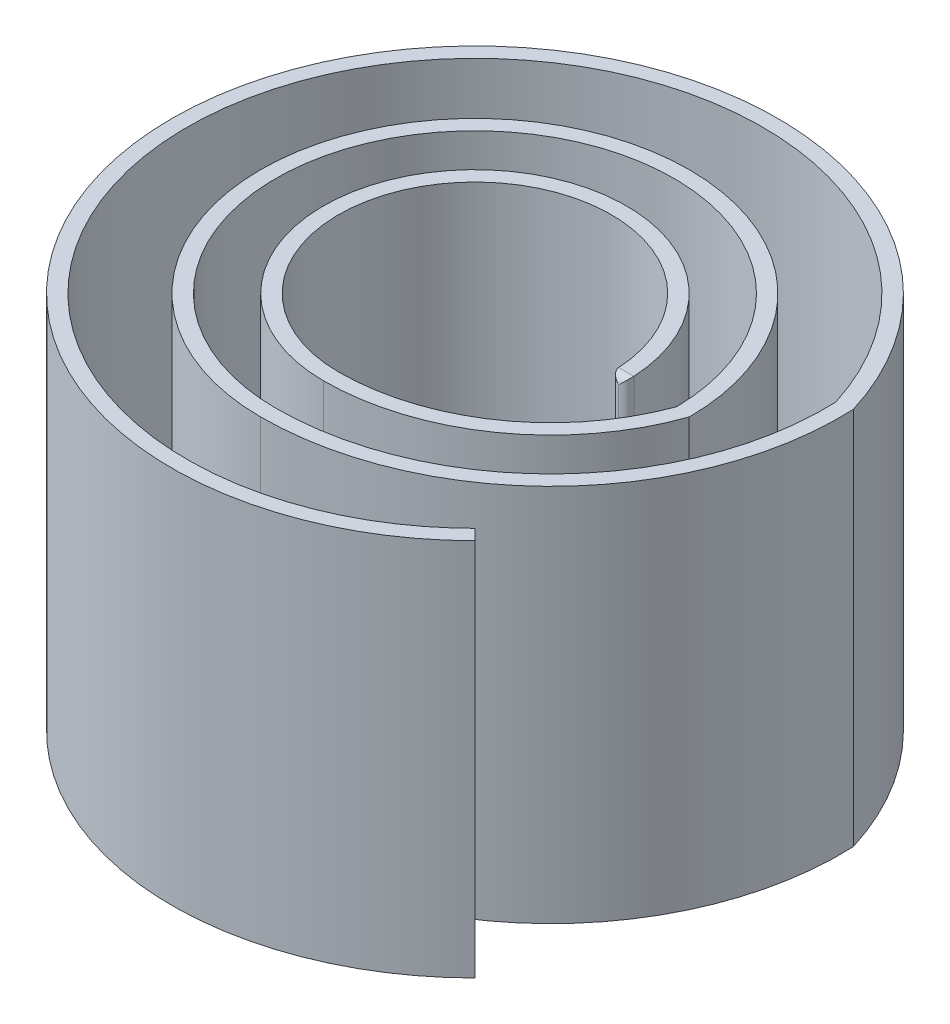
ISO-10303-21;
HEADER;
FILE_DESCRIPTION(('STEP AP214'),'2;1');
FILE_NAME('part.step','',(''),(''),'','','');
FILE_SCHEMA(('AUTOMOTIVE_DESIGN { 1 0 10303 214 1 1 1 1 }'));
ENDSEC;
DATA;
#1=APPLICATION_CONTEXT('core data for automotive mechanical design processes');
#2=APPLICATION_PROTOCOL_DEFINITION('international standard','automotive_design',2000,#1);
#3=PRODUCT_CONTEXT('',#1,'mechanical');
#4=PRODUCT('Part','Part','',(#3));
#5=PRODUCT_RELATED_PRODUCT_CATEGORY('part','',(#4));
#6=PRODUCT_DEFINITION_FORMATION('','',#4);
#7=PRODUCT_DEFINITION_CONTEXT('part definition',#1,'design');
#8=PRODUCT_DEFINITION('design','',#6,#7);
#9=PRODUCT_DEFINITION_SHAPE('','',#8);
#10=(LENGTH_UNIT() NAMED_UNIT(*) SI_UNIT(.MILLI.,.METRE.));
#11=(NAMED_UNIT(*) PLANE_ANGLE_UNIT() SI_UNIT($,.RADIAN.));
#12=(NAMED_UNIT(*) SI_UNIT($,.STERADIAN.) SOLID_ANGLE_UNIT());
#13=UNCERTAINTY_MEASURE_WITH_UNIT(LENGTH_MEASURE(1.E-05),#10,'distance_accuracy_value','');
#14=(GEOMETRIC_REPRESENTATION_CONTEXT(3) GLOBAL_UNCERTAINTY_ASSIGNED_CONTEXT((#13)) GLOBAL_UNIT_ASSIGNED_CONTEXT((#10,
#11,#12)) REPRESENTATION_CONTEXT('',''));
#15=CARTESIAN_POINT('',(0.,0.,0.));
#16=DIRECTION('',(0.,0.,1.));
#17=DIRECTION('',(1.,0.,0.));
#18=AXIS2_PLACEMENT_3D('',#15,#16,#17);
#19=CARTESIAN_POINT('',(0.,50.,0.));
#20=DIRECTION('',(0.,-1.,0.));
#21=DIRECTION('',(0.,0.,-1.));
#22=AXIS2_PLACEMENT_3D('',#19,#20,#21);
#23=CYLINDRICAL_SURFACE('',#22,38.);
#24=CARTESIAN_POINT('',(0.,0.,0.));
#25=DIRECTION('',(0.,1.,0.));
#26=DIRECTION('',(0.,0.,1.));
#27=AXIS2_PLACEMENT_3D('',#24,#25,#26);
#28=CIRCLE('',#27,38.);
#29=CARTESIAN_POINT('',(36.2583005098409,0.,-11.3725830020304));
#30=VERTEX_POINT('',#29);
#31=CARTESIAN_POINT('',(25.4191177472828,0.,28.2465653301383));
#32=VERTEX_POINT('',#31);
#33=EDGE_CURVE('E148',#30,#32,#28,.T.);
#34=ORIENTED_EDGE('',*,*,#33,.F.);
#35=DIRECTION('',(0.,-1.,0.));
#36=VECTOR('',#35,1.);
#37=CARTESIAN_POINT('',(36.2583005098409,50.,-11.3725830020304));
#38=LINE('',#37,#36);
#39=CARTESIAN_POINT('',(36.2583005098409,50.,-11.3725830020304));
#40=VERTEX_POINT('',#39);
#41=EDGE_CURVE('E81',#40,#30,#38,.T.);
#42=ORIENTED_EDGE('',*,*,#41,.F.);
#43=CARTESIAN_POINT('',(0.,50.,0.));
#44=DIRECTION('',(0.,1.,0.));
#45=DIRECTION('',(0.,0.,1.));
#46=AXIS2_PLACEMENT_3D('',#43,#44,#45);
#47=CIRCLE('',#46,38.);
#48=CARTESIAN_POINT('',(25.4191177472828,50.,28.2465653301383));
#49=VERTEX_POINT('',#48);
#50=EDGE_CURVE('E253',#40,#49,#47,.T.);
#51=ORIENTED_EDGE('',*,*,#50,.T.);
#52=DIRECTION('',(0.,-1.,0.));
#53=VECTOR('',#52,1.);
#54=CARTESIAN_POINT('',(25.4191177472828,50.,28.2465653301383));
#55=LINE('',#54,#53);
#56=EDGE_CURVE('E254',#49,#32,#55,.T.);
#57=ORIENTED_EDGE('',*,*,#56,.T.);
#58=EDGE_LOOP('',(#34,#42,#51,#57));
#59=FACE_BOUND('',#58,.T.);
#60=ADVANCED_FACE('F37',(#59),#23,.F.);
#61=CARTESIAN_POINT('',(0.,50.,-10.));
#62=DIRECTION('',(0.,-1.,0.));
#63=DIRECTION('',(0.,0.,-1.));
#64=AXIS2_PLACEMENT_3D('',#61,#62,#63);
#65=CYLINDRICAL_SURFACE('',#64,36.2842712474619);
#66=CARTESIAN_POINT('',(0.,0.,-10.));
#67=DIRECTION('',(0.,1.,0.));
#68=DIRECTION('',(0.,0.,1.));
#69=AXIS2_PLACEMENT_3D('',#66,#67,#68);
#70=CIRCLE('',#69,36.2842712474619);
#71=CARTESIAN_POINT('',(0.,0.,26.2842712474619));
#72=VERTEX_POINT('',#71);
#73=EDGE_CURVE('E234',#72,#30,#70,.T.);
#74=ORIENTED_EDGE('',*,*,#73,.F.);
#75=DIRECTION('',(0.,-1.,0.));
#76=VECTOR('',#75,1.);
#77=CARTESIAN_POINT('',(0.,50.,26.2842712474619));
#78=LINE('',#77,#76);
#79=CARTESIAN_POINT('',(0.,50.,26.2842712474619));
#80=VERTEX_POINT('',#79);
#81=EDGE_CURVE('E275',#80,#72,#78,.T.);
#82=ORIENTED_EDGE('',*,*,#81,.F.);
#83=CARTESIAN_POINT('',(0.,50.,-10.));
#84=DIRECTION('',(0.,1.,0.));
#85=DIRECTION('',(0.,0.,1.));
#86=AXIS2_PLACEMENT_3D('',#83,#84,#85);
#87=CIRCLE('',#86,36.2842712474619);
#88=EDGE_CURVE('E369',#80,#40,#87,.T.);
#89=ORIENTED_EDGE('',*,*,#88,.T.);
#90=ORIENTED_EDGE('',*,*,#41,.T.);
#91=EDGE_LOOP('',(#74,#82,#89,#90));
#92=FACE_BOUND('',#91,.T.);
#93=ADVANCED_FACE('F200',(#92),#65,.F.);
#94=CARTESIAN_POINT('',(0.,50.,0.));
#95=DIRECTION('',(0.,-1.,0.));
#96=DIRECTION('',(0.,0.,-1.));
#97=AXIS2_PLACEMENT_3D('',#94,#95,#96);
#98=CYLINDRICAL_SURFACE('',#97,26.2842712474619);
#99=CARTESIAN_POINT('',(0.,0.,0.));
#100=DIRECTION('',(0.,1.,0.));
#101=DIRECTION('',(0.,0.,1.));
#102=AXIS2_PLACEMENT_3D('',#99,#100,#101);
#103=CIRCLE('',#102,26.2842712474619);
#104=CARTESIAN_POINT('',(26.2820312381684,0.,-0.343145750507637));
#105=VERTEX_POINT('',#104);
#106=EDGE_CURVE('E230',#105,#72,#103,.T.);
#107=ORIENTED_EDGE('',*,*,#106,.F.);
#108=DIRECTION('',(0.,-1.,0.));
#109=VECTOR('',#108,1.);
#110=CARTESIAN_POINT('',(26.2820312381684,50.,-0.343145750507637));
#111=LINE('',#110,#109);
#112=CARTESIAN_POINT('',(26.2820312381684,50.,-0.343145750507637));
#113=VERTEX_POINT('',#112);
#114=EDGE_CURVE('E226',#113,#105,#111,.T.);
#115=ORIENTED_EDGE('',*,*,#114,.F.);
#116=CARTESIAN_POINT('',(0.,50.,0.));
#117=DIRECTION('',(0.,1.,0.));
#118=DIRECTION('',(0.,0.,1.));
#119=AXIS2_PLACEMENT_3D('',#116,#117,#118);
#120=CIRCLE('',#119,26.2842712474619);
#121=EDGE_CURVE('E280',#113,#80,#120,.T.);
#122=ORIENTED_EDGE('',*,*,#121,.T.);
#123=ORIENTED_EDGE('',*,*,#81,.T.);
#124=EDGE_LOOP('',(#107,#115,#122,#123));
#125=FACE_BOUND('',#124,.T.);
#126=ADVANCED_FACE('F205',(#125),#98,.F.);
#127=CARTESIAN_POINT('',(0.,50.,-10.));
#128=DIRECTION('',(0.,-1.,0.));
#129=DIRECTION('',(0.,0.,-1.));
#130=AXIS2_PLACEMENT_3D('',#127,#128,#129);
#131=CYLINDRICAL_SURFACE('',#130,28.);
#132=CARTESIAN_POINT('',(0.,0.,-10.));
#133=DIRECTION('',(0.,1.,0.));
#134=DIRECTION('',(0.,0.,1.));
#135=AXIS2_PLACEMENT_3D('',#132,#133,#134);
#136=CIRCLE('',#135,28.);
#137=CARTESIAN_POINT('',(0.,0.,18.));
#138=VERTEX_POINT('',#137);
#139=EDGE_CURVE('E220',#138,#105,#136,.T.);
#140=ORIENTED_EDGE('',*,*,#139,.F.);
#141=DIRECTION('',(0.,-1.,0.));
#142=VECTOR('',#141,1.);
#143=CARTESIAN_POINT('',(0.,50.,18.));
#144=LINE('',#143,#142);
#145=CARTESIAN_POINT('',(0.,50.,18.));
#146=VERTEX_POINT('',#145);
#147=EDGE_CURVE('E224',#146,#138,#144,.T.);
#148=ORIENTED_EDGE('',*,*,#147,.F.);
#149=CARTESIAN_POINT('',(0.,50.,-10.));
#150=DIRECTION('',(0.,1.,0.));
#151=DIRECTION('',(0.,0.,1.));
#152=AXIS2_PLACEMENT_3D('',#149,#150,#151);
#153=CIRCLE('',#152,28.);
#154=EDGE_CURVE('E328',#146,#113,#153,.T.);
#155=ORIENTED_EDGE('',*,*,#154,.T.);
#156=ORIENTED_EDGE('',*,*,#114,.T.);
#157=EDGE_LOOP('',(#140,#148,#155,#156));
#158=FACE_BOUND('',#157,.T.);
#159=ADVANCED_FACE('F209',(#158),#131,.F.);
#160=CARTESIAN_POINT('',(0.,50.,0.));
#161=DIRECTION('',(0.,-1.,0.));
#162=DIRECTION('',(0.,0.,-1.));
#163=AXIS2_PLACEMENT_3D('',#160,#161,#162);
#164=CYLINDRICAL_SURFACE('',#163,18.);
#165=DIRECTION('',(0.,-1.,0.));
#166=VECTOR('',#165,1.);
#167=CARTESIAN_POINT('',(17.9750519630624,50.,-0.947368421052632));
#168=LINE('',#167,#166);
#169=CARTESIAN_POINT('',(17.9750519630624,0.00138600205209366,-0.947368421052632));
#170=VERTEX_POINT('',#169);
#171=CARTESIAN_POINT('',(17.9750519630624,49.9986139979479,-0.947368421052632));
#172=VERTEX_POINT('',#171);
#173=EDGE_CURVE('E153',#170,#172,#168,.F.);
#174=ORIENTED_EDGE('',*,*,#173,.T.);
#175=CARTESIAN_POINT('',(17.9750519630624,49.9986139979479,-0.947368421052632));
#176=CARTESIAN_POINT('',(17.9745899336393,49.999075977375,-0.956134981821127));
#177=CARTESIAN_POINT('',(17.9741213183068,49.9994224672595,-0.964904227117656));
#178=CARTESIAN_POINT('',(17.9731709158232,49.9998844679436,-0.982448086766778));
#179=CARTESIAN_POINT('',(17.972689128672,49.9999999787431,-0.991222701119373));
#180=CARTESIAN_POINT('',(17.9722007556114,50.,-1.));
#181=B_SPLINE_CURVE_WITH_KNOTS('',3,(#175,#176,#177,#178,#179,#180),.UNSPECIFIED.,.F.,.F.,(4,2,
4),(0.,0.0263657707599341,0.052731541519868),.UNSPECIFIED.);
#182=CARTESIAN_POINT('',(17.9722007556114,50.,-1.));
#183=VERTEX_POINT('',#182);
#184=EDGE_CURVE('E151',#172,#183,#181,.T.);
#185=ORIENTED_EDGE('',*,*,#184,.T.);
#186=CARTESIAN_POINT('',(0.,50.,0.));
#187=DIRECTION('',(0.,1.,0.));
#188=DIRECTION('',(0.,0.,1.));
#189=AXIS2_PLACEMENT_3D('',#186,#187,#188);
#190=CIRCLE('',#189,18.);
#191=EDGE_CURVE('E141',#183,#146,#190,.T.);
#192=ORIENTED_EDGE('',*,*,#191,.T.);
#193=ORIENTED_EDGE('',*,*,#147,.T.);
#194=CARTESIAN_POINT('',(0.,0.,0.));
#195=DIRECTION('',(0.,1.,0.));
#196=DIRECTION('',(0.,0.,1.));
#197=AXIS2_PLACEMENT_3D('',#194,#195,#196);
#198=CIRCLE('',#197,18.);
#199=CARTESIAN_POINT('',(17.9722007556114,0.,-1.));
#200=VERTEX_POINT('',#199);
#201=EDGE_CURVE('E229',#200,#138,#198,.T.);
#202=ORIENTED_EDGE('',*,*,#201,.F.);
#203=CARTESIAN_POINT('',(17.9722007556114,0.,-1.));
#204=CARTESIAN_POINT('',(17.972689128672,2.12569477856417E-08,-0.991222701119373));
#205=CARTESIAN_POINT('',(17.9731709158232,0.00011553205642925,-0.982448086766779));
#206=CARTESIAN_POINT('',(17.9741213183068,0.000577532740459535,-0.964904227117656));
#207=CARTESIAN_POINT('',(17.9745899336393,0.000924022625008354,-0.956134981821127));
#208=CARTESIAN_POINT('',(17.9750519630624,0.00138600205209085,-0.947368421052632));
#209=B_SPLINE_CURVE_WITH_KNOTS('',3,(#203,#204,#205,#206,#207,#208),.UNSPECIFIED.,.F.,.F.,(4,2,
4),(0.,0.026365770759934,0.0527315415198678),.UNSPECIFIED.);
#210=EDGE_CURVE('E177',#200,#170,#209,.T.);
#211=ORIENTED_EDGE('',*,*,#210,.T.);
#212=EDGE_LOOP('',(#174,#185,#192,#193,#202,#211));
#213=FACE_BOUND('',#212,.T.);
#214=ADVANCED_FACE('F174',(#213),#164,.F.);
#215=CARTESIAN_POINT('',(0.,50.,0.));
#216=DIRECTION('',(0.,-1.,0.));
#217=DIRECTION('',(0.,0.,-1.));
#218=AXIS2_PLACEMENT_3D('',#215,#216,#217);
#219=CYLINDRICAL_SURFACE('',#218,20.);
#220=CARTESIAN_POINT('',(0.,50.,0.));
#221=DIRECTION('',(0.,1.,0.));
#222=DIRECTION('',(0.,0.,1.));
#223=AXIS2_PLACEMENT_3D('',#220,#221,#222);
#224=CIRCLE('',#223,20.);
#225=CARTESIAN_POINT('',(19.9722799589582,50.,-1.05263157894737));
#226=VERTEX_POINT('',#225);
#227=CARTESIAN_POINT('',(0.,50.,20.));
#228=VERTEX_POINT('',#227);
#229=EDGE_CURVE('E320',#226,#228,#224,.T.);
#230=ORIENTED_EDGE('',*,*,#229,.F.);
#231=DIRECTION('',(0.,-1.,0.));
#232=VECTOR('',#231,1.);
#233=CARTESIAN_POINT('',(19.9722799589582,50.,-1.05263157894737));
#234=LINE('',#233,#232);
#235=CARTESIAN_POINT('',(19.9722799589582,0.,-1.05263157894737));
#236=VERTEX_POINT('',#235);
#237=EDGE_CURVE('E144',#226,#236,#234,.T.);
#238=ORIENTED_EDGE('',*,*,#237,.T.);
#239=CARTESIAN_POINT('',(0.,0.,0.));
#240=DIRECTION('',(0.,1.,0.));
#241=DIRECTION('',(0.,0.,1.));
#242=AXIS2_PLACEMENT_3D('',#239,#240,#241);
#243=CIRCLE('',#242,20.);
#244=CARTESIAN_POINT('',(0.,0.,20.));
#245=VERTEX_POINT('',#244);
#246=EDGE_CURVE('E232',#236,#245,#243,.T.);
#247=ORIENTED_EDGE('',*,*,#246,.T.);
#248=DIRECTION('',(0.,-1.,0.));
#249=VECTOR('',#248,1.);
#250=CARTESIAN_POINT('',(0.,50.,20.));
#251=LINE('',#250,#249);
#252=EDGE_CURVE('E271',#228,#245,#251,.T.);
#253=ORIENTED_EDGE('',*,*,#252,.F.);
#254=EDGE_LOOP('',(#230,#238,#247,#253));
#255=FACE_BOUND('',#254,.T.);
#256=ADVANCED_FACE('F216',(#255),#219,.T.);
#257=CARTESIAN_POINT('',(0.,50.,-10.));
#258=DIRECTION('',(0.,-1.,0.));
#259=DIRECTION('',(0.,0.,-1.));
#260=AXIS2_PLACEMENT_3D('',#257,#258,#259);
#261=CYLINDRICAL_SURFACE('',#260,30.);
#262=CARTESIAN_POINT('',(0.,0.,-10.));
#263=DIRECTION('',(0.,1.,0.));
#264=DIRECTION('',(0.,0.,1.));
#265=AXIS2_PLACEMENT_3D('',#262,#263,#264);
#266=CIRCLE('',#265,30.);
#267=CARTESIAN_POINT('',(28.2842712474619,0.,0.));
#268=VERTEX_POINT('',#267);
#269=EDGE_CURVE('E239',#245,#268,#266,.T.);
#270=ORIENTED_EDGE('',*,*,#269,.T.);
#271=DIRECTION('',(0.,-1.,0.));
#272=VECTOR('',#271,1.);
#273=CARTESIAN_POINT('',(28.2842712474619,50.,0.));
#274=LINE('',#273,#272);
#275=CARTESIAN_POINT('',(28.2842712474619,50.,0.));
#276=VERTEX_POINT('',#275);
#277=EDGE_CURVE('E268',#276,#268,#274,.T.);
#278=ORIENTED_EDGE('',*,*,#277,.F.);
#279=CARTESIAN_POINT('',(0.,50.,-10.));
#280=DIRECTION('',(0.,1.,0.));
#281=DIRECTION('',(0.,0.,1.));
#282=AXIS2_PLACEMENT_3D('',#279,#280,#281);
#283=CIRCLE('',#282,30.);
#284=EDGE_CURVE('E324',#228,#276,#283,.T.);
#285=ORIENTED_EDGE('',*,*,#284,.F.);
#286=ORIENTED_EDGE('',*,*,#252,.T.);
#287=EDGE_LOOP('',(#270,#278,#285,#286));
#288=FACE_BOUND('',#287,.T.);
#289=ADVANCED_FACE('F311',(#288),#261,.T.);
#290=CARTESIAN_POINT('',(0.,50.,0.));
#291=DIRECTION('',(0.,-1.,0.));
#292=DIRECTION('',(0.,0.,-1.));
#293=AXIS2_PLACEMENT_3D('',#290,#291,#292);
#294=CYLINDRICAL_SURFACE('',#293,28.2842712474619);
#295=CARTESIAN_POINT('',(0.,0.,0.));
#296=DIRECTION('',(0.,1.,0.));
#297=DIRECTION('',(0.,0.,1.));
#298=AXIS2_PLACEMENT_3D('',#295,#296,#297);
#299=CIRCLE('',#298,28.2842712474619);
#300=CARTESIAN_POINT('',(0.,0.,28.2842712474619));
#301=VERTEX_POINT('',#300);
#302=EDGE_CURVE('E241',#268,#301,#299,.T.);
#303=ORIENTED_EDGE('',*,*,#302,.T.);
#304=DIRECTION('',(0.,-1.,0.));
#305=VECTOR('',#304,1.);
#306=CARTESIAN_POINT('',(0.,50.,28.2842712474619));
#307=LINE('',#306,#305);
#308=CARTESIAN_POINT('',(0.,50.,28.2842712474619));
#309=VERTEX_POINT('',#308);
#310=EDGE_CURVE('E265',#309,#301,#307,.T.);
#311=ORIENTED_EDGE('',*,*,#310,.F.);
#312=CARTESIAN_POINT('',(0.,50.,0.));
#313=DIRECTION('',(0.,1.,0.));
#314=DIRECTION('',(0.,0.,1.));
#315=AXIS2_PLACEMENT_3D('',#312,#313,#314);
#316=CIRCLE('',#315,28.2842712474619);
#317=EDGE_CURVE('E326',#276,#309,#316,.T.);
#318=ORIENTED_EDGE('',*,*,#317,.F.);
#319=ORIENTED_EDGE('',*,*,#277,.T.);
#320=EDGE_LOOP('',(#303,#311,#318,#319));
#321=FACE_BOUND('',#320,.T.);
#322=ADVANCED_FACE('F307',(#321),#294,.T.);
#323=CARTESIAN_POINT('',(0.,50.,-10.));
#324=DIRECTION('',(0.,-1.,0.));
#325=DIRECTION('',(0.,0.,-1.));
#326=AXIS2_PLACEMENT_3D('',#323,#324,#325);
#327=CYLINDRICAL_SURFACE('',#326,38.2842712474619);
#328=CARTESIAN_POINT('',(0.,0.,-10.));
#329=DIRECTION('',(0.,1.,0.));
#330=DIRECTION('',(0.,0.,1.));
#331=AXIS2_PLACEMENT_3D('',#328,#329,#330);
#332=CIRCLE('',#331,38.2842712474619);
#333=CARTESIAN_POINT('',(38.2458063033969,0.,-11.715728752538));
#334=VERTEX_POINT('',#333);
#335=EDGE_CURVE('E243',#301,#334,#332,.T.);
#336=ORIENTED_EDGE('',*,*,#335,.T.);
#337=DIRECTION('',(0.,-1.,0.));
#338=VECTOR('',#337,1.);
#339=CARTESIAN_POINT('',(38.2458063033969,50.,-11.715728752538));
#340=LINE('',#339,#338);
#341=CARTESIAN_POINT('',(38.2458063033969,50.,-11.715728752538));
#342=VERTEX_POINT('',#341);
#343=EDGE_CURVE('E262',#342,#334,#340,.T.);
#344=ORIENTED_EDGE('',*,*,#343,.F.);
#345=CARTESIAN_POINT('',(0.,50.,-10.));
#346=DIRECTION('',(0.,1.,0.));
#347=DIRECTION('',(0.,0.,1.));
#348=AXIS2_PLACEMENT_3D('',#345,#346,#347);
#349=CIRCLE('',#348,38.2842712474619);
#350=EDGE_CURVE('E334',#309,#342,#349,.T.);
#351=ORIENTED_EDGE('',*,*,#350,.F.);
#352=ORIENTED_EDGE('',*,*,#310,.T.);
#353=EDGE_LOOP('',(#336,#344,#351,#352));
#354=FACE_BOUND('',#353,.T.);
#355=ADVANCED_FACE('F303',(#354),#327,.T.);
#356=CARTESIAN_POINT('',(0.,50.,0.));
#357=DIRECTION('',(0.,-1.,0.));
#358=DIRECTION('',(0.,0.,-1.));
#359=AXIS2_PLACEMENT_3D('',#356,#357,#358);
#360=CYLINDRICAL_SURFACE('',#359,40.);
#361=CARTESIAN_POINT('',(0.,0.,0.));
#362=DIRECTION('',(0.,1.,0.));
#363=DIRECTION('',(0.,0.,1.));
#364=AXIS2_PLACEMENT_3D('',#361,#362,#363);
#365=CIRCLE('',#364,40.);
#366=CARTESIAN_POINT('',(28.2842712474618,0.,28.2842712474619));
#367=VERTEX_POINT('',#366);
#368=EDGE_CURVE('E245',#334,#367,#365,.T.);
#369=ORIENTED_EDGE('',*,*,#368,.T.);
#370=DIRECTION('',(0.,-1.,0.));
#371=VECTOR('',#370,1.);
#372=CARTESIAN_POINT('',(28.2842712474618,50.,28.2842712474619));
#373=LINE('',#372,#371);
#374=CARTESIAN_POINT('',(28.2842712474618,50.,28.2842712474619));
#375=VERTEX_POINT('',#374);
#376=EDGE_CURVE('E259',#375,#367,#373,.T.);
#377=ORIENTED_EDGE('',*,*,#376,.F.);
#378=CARTESIAN_POINT('',(0.,50.,0.));
#379=DIRECTION('',(0.,1.,0.));
#380=DIRECTION('',(0.,0.,1.));
#381=AXIS2_PLACEMENT_3D('',#378,#379,#380);
#382=CIRCLE('',#381,40.);
#383=EDGE_CURVE('E337',#342,#375,#382,.T.);
#384=ORIENTED_EDGE('',*,*,#383,.F.);
#385=ORIENTED_EDGE('',*,*,#343,.T.);
#386=EDGE_LOOP('',(#369,#377,#384,#385));
#387=FACE_BOUND('',#386,.T.);
#388=ADVANCED_FACE('F299',(#387),#360,.T.);
#389=CARTESIAN_POINT('',(0.,50.,0.));
#390=DIRECTION('',(-0.707106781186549,0.,0.707106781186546));
#391=DIRECTION('',(0.707106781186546,0.,0.707106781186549));
#392=AXIS2_PLACEMENT_3D('',#389,#390,#391);
#393=PLANE('',#392);
#394=DIRECTION('',(-0.707106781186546,0.,-0.707106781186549));
#395=VECTOR('',#394,1.);
#396=CARTESIAN_POINT('',(0.,0.,0.));
#397=LINE('',#396,#395);
#398=CARTESIAN_POINT('',(26.8700576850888,0.,26.8700576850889));
#399=VERTEX_POINT('',#398);
#400=EDGE_CURVE('E247',#367,#399,#397,.T.);
#401=ORIENTED_EDGE('',*,*,#400,.T.);
#402=DIRECTION('',(0.,-1.,0.));
#403=VECTOR('',#402,1.);
#404=CARTESIAN_POINT('',(26.8700576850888,50.,26.8700576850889));
#405=LINE('',#404,#403);
#406=CARTESIAN_POINT('',(26.8700576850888,50.,26.8700576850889));
#407=VERTEX_POINT('',#406);
#408=EDGE_CURVE('E256',#407,#399,#405,.T.);
#409=ORIENTED_EDGE('',*,*,#408,.F.);
#410=DIRECTION('',(-0.707106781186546,0.,-0.707106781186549));
#411=VECTOR('',#410,1.);
#412=CARTESIAN_POINT('',(0.,50.,0.));
#413=LINE('',#412,#411);
#414=EDGE_CURVE('E340',#375,#407,#413,.T.);
#415=ORIENTED_EDGE('',*,*,#414,.F.);
#416=ORIENTED_EDGE('',*,*,#376,.T.);
#417=EDGE_LOOP('',(#401,#409,#415,#416));
#418=FACE_BOUND('',#417,.T.);
#419=ADVANCED_FACE('F295',(#418),#393,.F.);
#420=CARTESIAN_POINT('',(26.1445877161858,50.,27.5583115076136));
#421=DIRECTION('',(-0.688253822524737,0.,-0.725469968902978));
#422=DIRECTION('',(-0.725469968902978,0.,0.688253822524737));
#423=AXIS2_PLACEMENT_3D('',#420,#421,#422);
#424=PLANE('',#423);
#425=DIRECTION('',(0.725469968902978,0.,-0.688253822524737));
#426=VECTOR('',#425,1.);
#427=CARTESIAN_POINT('',(26.1445877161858,0.,27.5583115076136));
#428=LINE('',#427,#426);
#429=EDGE_CURVE('E250',#32,#399,#428,.T.);
#430=ORIENTED_EDGE('',*,*,#429,.F.);
#431=ORIENTED_EDGE('',*,*,#56,.F.);
#432=DIRECTION('',(0.725469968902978,0.,-0.688253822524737));
#433=VECTOR('',#432,1.);
#434=CARTESIAN_POINT('',(26.1445877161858,50.,27.5583115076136));
#435=LINE('',#434,#433);
#436=EDGE_CURVE('E257',#49,#407,#435,.T.);
#437=ORIENTED_EDGE('',*,*,#436,.T.);
#438=ORIENTED_EDGE('',*,*,#408,.T.);
#439=EDGE_LOOP('',(#430,#431,#437,#438));
#440=FACE_BOUND('',#439,.T.);
#441=ADVANCED_FACE('F290',(#440),#424,.T.);
#442=CARTESIAN_POINT('',(0.,50.,0.));
#443=DIRECTION('',(0.,1.,0.));
#444=DIRECTION('',(0.,0.,1.));
#445=AXIS2_PLACEMENT_3D('',#442,#443,#444);
#446=PLANE('',#445);
#447=ORIENTED_EDGE('',*,*,#191,.F.);
#448=DIRECTION('',(-1.,0.,0.));
#449=VECTOR('',#448,1.);
#450=CARTESIAN_POINT('',(0.,50.,-1.));
#451=LINE('',#450,#449);
#452=CARTESIAN_POINT('',(19.9736659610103,50.,-1.));
#453=VERTEX_POINT('',#452);
#454=EDGE_CURVE('E134',#183,#453,#451,.F.);
#455=ORIENTED_EDGE('',*,*,#454,.T.);
#456=CARTESIAN_POINT('',(18.9736659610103,50.,-1.));
#457=DIRECTION('',(0.,1.,0.));
#458=DIRECTION('',(0.,0.,1.));
#459=AXIS2_PLACEMENT_3D('',#456,#457,#458);
#460=CIRCLE('',#459,1.);
#461=EDGE_CURVE('E137',#453,#226,#460,.T.);
#462=ORIENTED_EDGE('',*,*,#461,.T.);
#463=ORIENTED_EDGE('',*,*,#229,.T.);
#464=ORIENTED_EDGE('',*,*,#284,.T.);
#465=ORIENTED_EDGE('',*,*,#317,.T.);
#466=ORIENTED_EDGE('',*,*,#350,.T.);
#467=ORIENTED_EDGE('',*,*,#383,.T.);
#468=ORIENTED_EDGE('',*,*,#414,.T.);
#469=ORIENTED_EDGE('',*,*,#436,.F.);
#470=ORIENTED_EDGE('',*,*,#50,.F.);
#471=ORIENTED_EDGE('',*,*,#88,.F.);
#472=ORIENTED_EDGE('',*,*,#121,.F.);
#473=ORIENTED_EDGE('',*,*,#154,.F.);
#474=EDGE_LOOP('',(#447,#455,#462,#463,#464,#465,#466,#467,#468,#469,#470,#471,#472,#473));
#475=FACE_BOUND('',#474,.T.);
#476=ADVANCED_FACE('F135',(#475),#446,.T.);
#477=CARTESIAN_POINT('',(0.,0.,0.));
#478=DIRECTION('',(0.,1.,0.));
#479=DIRECTION('',(0.,0.,1.));
#480=AXIS2_PLACEMENT_3D('',#477,#478,#479);
#481=PLANE('',#480);
#482=ORIENTED_EDGE('',*,*,#246,.F.);
#483=CARTESIAN_POINT('',(18.9736659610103,0.,-1.));
#484=DIRECTION('',(0.,1.,0.));
#485=DIRECTION('',(0.,0.,1.));
#486=AXIS2_PLACEMENT_3D('',#483,#484,#485);
#487=CIRCLE('',#486,1.);
#488=CARTESIAN_POINT('',(19.9736659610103,0.,-1.));
#489=VERTEX_POINT('',#488);
#490=EDGE_CURVE('E11',#236,#489,#487,.F.);
#491=ORIENTED_EDGE('',*,*,#490,.T.);
#492=DIRECTION('',(-1.,0.,0.));
#493=VECTOR('',#492,1.);
#494=CARTESIAN_POINT('',(18.,0.,-1.));
#495=LINE('',#494,#493);
#496=EDGE_CURVE('E48',#489,#200,#495,.T.);
#497=ORIENTED_EDGE('',*,*,#496,.T.);
#498=ORIENTED_EDGE('',*,*,#201,.T.);
#499=ORIENTED_EDGE('',*,*,#139,.T.);
#500=ORIENTED_EDGE('',*,*,#106,.T.);
#501=ORIENTED_EDGE('',*,*,#73,.T.);
#502=ORIENTED_EDGE('',*,*,#33,.T.);
#503=ORIENTED_EDGE('',*,*,#429,.T.);
#504=ORIENTED_EDGE('',*,*,#400,.F.);
#505=ORIENTED_EDGE('',*,*,#368,.F.);
#506=ORIENTED_EDGE('',*,*,#335,.F.);
#507=ORIENTED_EDGE('',*,*,#302,.F.);
#508=ORIENTED_EDGE('',*,*,#269,.F.);
#509=EDGE_LOOP('',(#482,#491,#497,#498,#499,#500,#501,#502,#503,#504,#505,#506,#507,#508));
#510=FACE_BOUND('',#509,.T.);
#511=ADVANCED_FACE('F198',(#510),#481,.F.);
#512=CARTESIAN_POINT('',(0.,49.,-1.));
#513=DIRECTION('',(-1.,0.,0.));
#514=DIRECTION('',(0.,0.,1.));
#515=AXIS2_PLACEMENT_3D('',#512,#513,#514);
#516=CYLINDRICAL_SURFACE('',#515,1.);
#517=CARTESIAN_POINT('',(18.9736659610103,49.,-1.));
#518=DIRECTION('',(0.707106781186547,-0.707106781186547,0.));
#519=DIRECTION('',(-0.707106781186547,-0.707106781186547,0.));
#520=AXIS2_PLACEMENT_3D('',#517,#518,#519);
#521=ELLIPSE('',#520,1.41421356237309,1.);
#522=CARTESIAN_POINT('',(18.9736659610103,49.,0.));
#523=VERTEX_POINT('',#522);
#524=EDGE_CURVE('E42',#453,#523,#521,.T.);
#525=ORIENTED_EDGE('',*,*,#524,.F.);
#526=ORIENTED_EDGE('',*,*,#454,.F.);
#527=ORIENTED_EDGE('',*,*,#184,.F.);
#528=CARTESIAN_POINT('',(18.9736659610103,49.,-1.));
#529=DIRECTION('',(-0.707106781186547,-0.707106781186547,0.));
#530=DIRECTION('',(-0.707106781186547,0.707106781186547,0.));
#531=AXIS2_PLACEMENT_3D('',#528,#529,#530);
#532=ELLIPSE('',#531,1.41421356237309,1.);
#533=EDGE_CURVE('E146',#523,#172,#532,.T.);
#534=ORIENTED_EDGE('',*,*,#533,.F.);
#535=EDGE_LOOP('',(#525,#526,#527,#534));
#536=FACE_BOUND('',#535,.T.);
#537=ADVANCED_FACE('F39',(#536),#516,.T.);
#538=CARTESIAN_POINT('',(18.9736659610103,50.,-1.));
#539=DIRECTION('',(0.,-1.,0.));
#540=DIRECTION('',(0.,0.,-1.));
#541=AXIS2_PLACEMENT_3D('',#538,#539,#540);
#542=CYLINDRICAL_SURFACE('',#541,1.);
#543=CARTESIAN_POINT('',(18.9736659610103,1.,-1.));
#544=DIRECTION('',(0.707106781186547,0.707106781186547,0.));
#545=DIRECTION('',(0.707106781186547,-0.707106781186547,0.));
#546=AXIS2_PLACEMENT_3D('',#543,#544,#545);
#547=ELLIPSE('',#546,1.41421356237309,1.);
#548=CARTESIAN_POINT('',(18.9736659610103,1.,0.));
#549=VERTEX_POINT('',#548);
#550=EDGE_CURVE('E66',#489,#549,#547,.F.);
#551=ORIENTED_EDGE('',*,*,#550,.F.);
#552=ORIENTED_EDGE('',*,*,#490,.F.);
#553=ORIENTED_EDGE('',*,*,#237,.F.);
#554=ORIENTED_EDGE('',*,*,#461,.F.);
#555=ORIENTED_EDGE('',*,*,#524,.T.);
#556=DIRECTION('',(0.,1.,0.));
#557=VECTOR('',#556,1.);
#558=CARTESIAN_POINT('',(18.9736659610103,50.,0.));
#559=LINE('',#558,#557);
#560=EDGE_CURVE('E167',#549,#523,#559,.T.);
#561=ORIENTED_EDGE('',*,*,#560,.F.);
#562=EDGE_LOOP('',(#551,#552,#553,#554,#555,#561));
#563=FACE_BOUND('',#562,.T.);
#564=ADVANCED_FACE('F150',(#563),#542,.T.);
#565=CARTESIAN_POINT('',(0.,1.,-1.));
#566=DIRECTION('',(1.,0.,0.));
#567=DIRECTION('',(0.,0.,-1.));
#568=AXIS2_PLACEMENT_3D('',#565,#566,#567);
#569=CYLINDRICAL_SURFACE('',#568,1.);
#570=ORIENTED_EDGE('',*,*,#496,.F.);
#571=ORIENTED_EDGE('',*,*,#550,.T.);
#572=CARTESIAN_POINT('',(18.9736659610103,1.,-1.));
#573=DIRECTION('',(0.707106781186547,-0.707106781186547,0.));
#574=DIRECTION('',(0.707106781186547,0.707106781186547,0.));
#575=AXIS2_PLACEMENT_3D('',#572,#573,#574);
#576=ELLIPSE('',#575,1.41421356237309,1.);
#577=EDGE_CURVE('E164',#170,#549,#576,.F.);
#578=ORIENTED_EDGE('',*,*,#577,.F.);
#579=ORIENTED_EDGE('',*,*,#210,.F.);
#580=EDGE_LOOP('',(#570,#571,#578,#579));
#581=FACE_BOUND('',#580,.T.);
#582=ADVANCED_FACE('F189',(#581),#569,.T.);
#583=CARTESIAN_POINT('',(18.9736659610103,50.,-1.));
#584=DIRECTION('',(0.,-1.,0.));
#585=DIRECTION('',(0.,0.,-1.));
#586=AXIS2_PLACEMENT_3D('',#583,#584,#585);
#587=CYLINDRICAL_SURFACE('',#586,1.);
#588=ORIENTED_EDGE('',*,*,#533,.T.);
#589=ORIENTED_EDGE('',*,*,#173,.F.);
#590=ORIENTED_EDGE('',*,*,#577,.T.);
#591=ORIENTED_EDGE('',*,*,#560,.T.);
#592=EDGE_LOOP('',(#588,#589,#590,#591));
#593=FACE_BOUND('',#592,.T.);
#594=ADVANCED_FACE('F171',(#593),#587,.T.);
#595=CLOSED_SHELL('',(#60,#93,#126,#159,#214,#256,#289,#322,#355,#388,#419,#441,#476,#511,#537,
#564,#582,#594));
#596=MANIFOLD_SOLID_BREP('B2',#595);
#597=ADVANCED_BREP_SHAPE_REPRESENTATION('',(#18,#596),#14);
#598=SHAPE_DEFINITION_REPRESENTATION(#9,#597);
ENDSEC;
END-ISO-10303-21;
